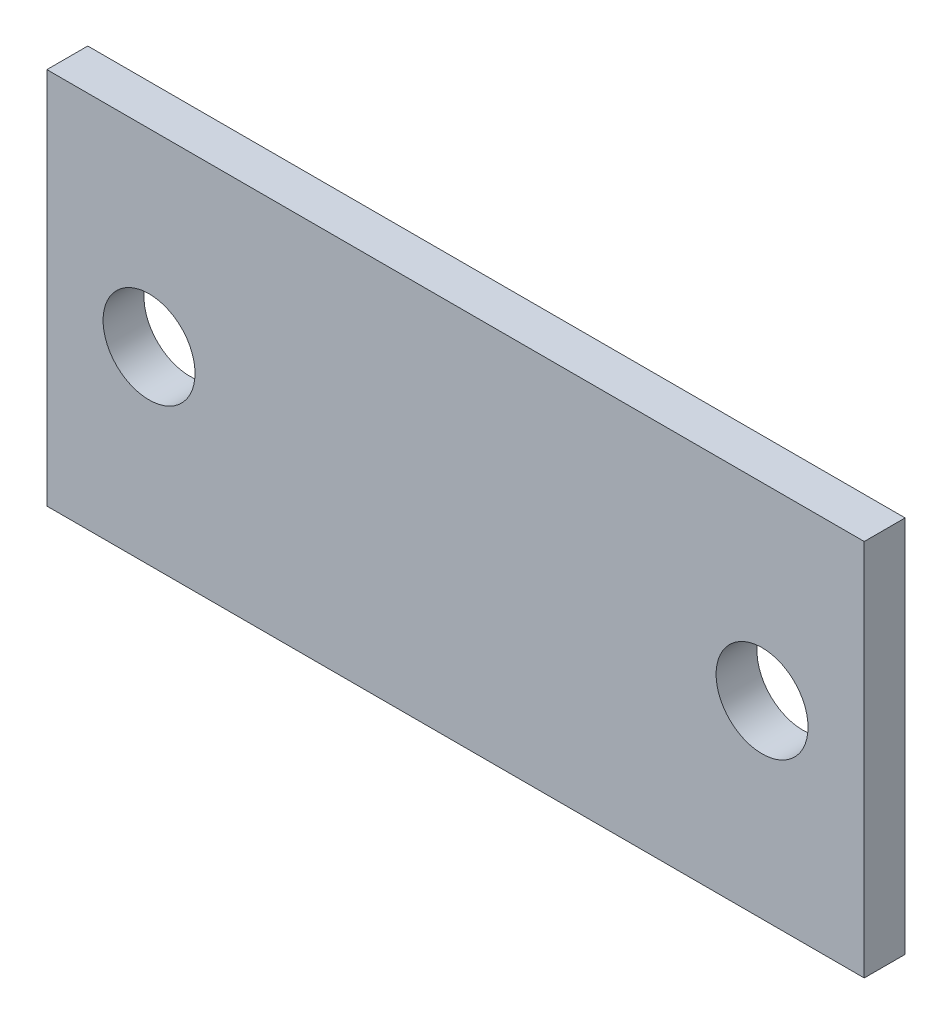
from build123d import *

# Parameters (mm, degrees)
ESQUISSE1_W      = 80
ESQUISSE1_H      = 37
ESQUISSE1_R      = 4.5
EXTRUSION1_DEPTH = 4


with BuildPart() as part:
    # Esquisse1 → Extrusion1 (new body)
    with BuildSketch(Plane.XY):
        with Locations((175, 0)):
            Rectangle(ESQUISSE1_W, ESQUISSE1_H)
        with Locations((205, 0)):
            Circle(ESQUISSE1_R, mode=Mode.SUBTRACT)
        with Locations((145, 0)):
            Circle(ESQUISSE1_R, mode=Mode.SUBTRACT)
    extrude(amount=EXTRUSION1_DEPTH)


solid = part.part
